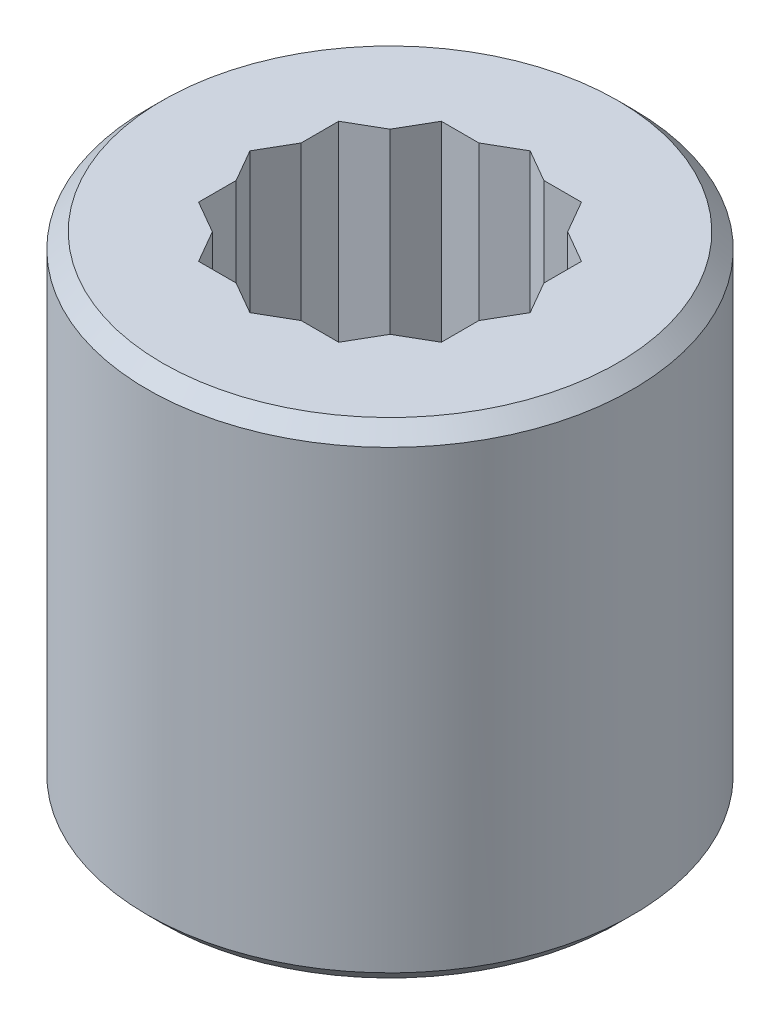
ISO-10303-21;
HEADER;
FILE_DESCRIPTION(('STEP AP214'),'2;1');
FILE_NAME('part.step','',(''),(''),'','','');
FILE_SCHEMA(('AUTOMOTIVE_DESIGN { 1 0 10303 214 1 1 1 1 }'));
ENDSEC;
DATA;
#1=APPLICATION_CONTEXT('core data for automotive mechanical design processes');
#2=APPLICATION_PROTOCOL_DEFINITION('international standard','automotive_design',2000,#1);
#3=PRODUCT_CONTEXT('',#1,'mechanical');
#4=PRODUCT('Part','Part','',(#3));
#5=PRODUCT_RELATED_PRODUCT_CATEGORY('part','',(#4));
#6=PRODUCT_DEFINITION_FORMATION('','',#4);
#7=PRODUCT_DEFINITION_CONTEXT('part definition',#1,'design');
#8=PRODUCT_DEFINITION('design','',#6,#7);
#9=PRODUCT_DEFINITION_SHAPE('','',#8);
#10=(LENGTH_UNIT() NAMED_UNIT(*) SI_UNIT(.MILLI.,.METRE.));
#11=(NAMED_UNIT(*) PLANE_ANGLE_UNIT() SI_UNIT($,.RADIAN.));
#12=(NAMED_UNIT(*) SI_UNIT($,.STERADIAN.) SOLID_ANGLE_UNIT());
#13=UNCERTAINTY_MEASURE_WITH_UNIT(LENGTH_MEASURE(1.E-05),#10,'distance_accuracy_value','');
#14=(GEOMETRIC_REPRESENTATION_CONTEXT(3) GLOBAL_UNCERTAINTY_ASSIGNED_CONTEXT((#13)) GLOBAL_UNIT_ASSIGNED_CONTEXT((#10,
#11,#12)) REPRESENTATION_CONTEXT('',''));
#15=CARTESIAN_POINT('',(0.,0.,0.));
#16=DIRECTION('',(0.,0.,1.));
#17=DIRECTION('',(1.,0.,0.));
#18=AXIS2_PLACEMENT_3D('',#15,#16,#17);
#19=CARTESIAN_POINT('',(3.66617420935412,12.7,6.35));
#20=DIRECTION('',(0.866025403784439,0.,0.5));
#21=DIRECTION('',(0.5,0.,-0.866025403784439));
#22=AXIS2_PLACEMENT_3D('',#19,#20,#21);
#23=PLANE('',#22);
#24=DIRECTION('',(0.5,0.,-0.866025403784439));
#25=VECTOR('',#24,1.);
#26=CARTESIAN_POINT('',(3.66617420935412,12.7,6.35));
#27=LINE('',#26,#25);
#28=CARTESIAN_POINT('',(6.35,12.7,1.70147737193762));
#29=VERTEX_POINT('',#28);
#30=CARTESIAN_POINT('',(7.33234841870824,12.7,0.));
#31=VERTEX_POINT('',#30);
#32=EDGE_CURVE('E361',#29,#31,#27,.T.);
#33=ORIENTED_EDGE('',*,*,#32,.F.);
#34=DIRECTION('',(0.,1.,0.));
#35=VECTOR('',#34,1.);
#36=CARTESIAN_POINT('',(6.35,12.7,1.70147737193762));
#37=LINE('',#36,#35);
#38=CARTESIAN_POINT('',(6.35,25.3999999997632,1.70147737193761));
#39=VERTEX_POINT('',#38);
#40=EDGE_CURVE('E334',#29,#39,#37,.T.);
#41=ORIENTED_EDGE('',*,*,#40,.T.);
#42=DIRECTION('',(0.5,0.,-0.866025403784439));
#43=VECTOR('',#42,1.);
#44=CARTESIAN_POINT('',(3.66617420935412,25.4,6.35));
#45=LINE('',#44,#43);
#46=CARTESIAN_POINT('',(7.33234841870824,25.4,0.));
#47=VERTEX_POINT('',#46);
#48=EDGE_CURVE('E337',#39,#47,#45,.T.);
#49=ORIENTED_EDGE('',*,*,#48,.T.);
#50=DIRECTION('',(0.,1.,0.));
#51=VECTOR('',#50,1.);
#52=CARTESIAN_POINT('',(7.33234841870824,12.7,0.));
#53=LINE('',#52,#51);
#54=EDGE_CURVE('E385',#31,#47,#53,.T.);
#55=ORIENTED_EDGE('',*,*,#54,.F.);
#56=EDGE_LOOP('',(#33,#41,#49,#55));
#57=FACE_BOUND('',#56,.T.);
#58=ADVANCED_FACE('F28',(#57),#23,.F.);
#59=CARTESIAN_POINT('',(-3.66617420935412,12.7,6.35));
#60=DIRECTION('',(0.,0.,1.));
#61=DIRECTION('',(1.,0.,0.));
#62=AXIS2_PLACEMENT_3D('',#59,#60,#61);
#63=PLANE('',#62);
#64=DIRECTION('',(1.,0.,0.));
#65=VECTOR('',#64,1.);
#66=CARTESIAN_POINT('',(-3.66617420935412,12.7,6.35));
#67=LINE('',#66,#65);
#68=CARTESIAN_POINT('',(1.70147737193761,12.7,6.35000000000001));
#69=VERTEX_POINT('',#68);
#70=CARTESIAN_POINT('',(3.66617420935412,12.7,6.35));
#71=VERTEX_POINT('',#70);
#72=EDGE_CURVE('E381',#69,#71,#67,.T.);
#73=ORIENTED_EDGE('',*,*,#72,.F.);
#74=DIRECTION('',(0.,1.,0.));
#75=VECTOR('',#74,1.);
#76=CARTESIAN_POINT('',(1.70147737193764,12.7,6.35));
#77=LINE('',#76,#75);
#78=CARTESIAN_POINT('',(1.70147737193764,25.3999999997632,6.35));
#79=VERTEX_POINT('',#78);
#80=EDGE_CURVE('E325',#69,#79,#77,.T.);
#81=ORIENTED_EDGE('',*,*,#80,.T.);
#82=DIRECTION('',(1.,0.,0.));
#83=VECTOR('',#82,1.);
#84=CARTESIAN_POINT('',(-3.66617420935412,25.4,6.35));
#85=LINE('',#84,#83);
#86=CARTESIAN_POINT('',(3.66617420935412,25.4,6.35));
#87=VERTEX_POINT('',#86);
#88=EDGE_CURVE('E357',#79,#87,#85,.T.);
#89=ORIENTED_EDGE('',*,*,#88,.T.);
#90=DIRECTION('',(0.,1.,0.));
#91=VECTOR('',#90,1.);
#92=CARTESIAN_POINT('',(3.66617420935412,12.7,6.35));
#93=LINE('',#92,#91);
#94=EDGE_CURVE('E386',#71,#87,#93,.T.);
#95=ORIENTED_EDGE('',*,*,#94,.F.);
#96=EDGE_LOOP('',(#73,#81,#89,#95));
#97=FACE_BOUND('',#96,.T.);
#98=ADVANCED_FACE('F460',(#97),#63,.F.);
#99=CARTESIAN_POINT('',(-7.33234841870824,12.7,0.));
#100=DIRECTION('',(-0.866025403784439,0.,0.5));
#101=DIRECTION('',(0.5,0.,0.866025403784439));
#102=AXIS2_PLACEMENT_3D('',#99,#100,#101);
#103=PLANE('',#102);
#104=DIRECTION('',(0.5,0.,0.866025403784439));
#105=VECTOR('',#104,1.);
#106=CARTESIAN_POINT('',(-7.33234841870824,12.7,0.));
#107=LINE('',#106,#105);
#108=CARTESIAN_POINT('',(-4.64852262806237,12.7,4.64852262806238));
#109=VERTEX_POINT('',#108);
#110=CARTESIAN_POINT('',(-3.66617420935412,12.7,6.35));
#111=VERTEX_POINT('',#110);
#112=EDGE_CURVE('E377',#109,#111,#107,.T.);
#113=ORIENTED_EDGE('',*,*,#112,.F.);
#114=DIRECTION('',(0.,1.,0.));
#115=VECTOR('',#114,1.);
#116=CARTESIAN_POINT('',(-4.64852262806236,12.7,4.64852262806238));
#117=LINE('',#116,#115);
#118=CARTESIAN_POINT('',(-4.64852262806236,25.3999999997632,4.64852262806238));
#119=VERTEX_POINT('',#118);
#120=EDGE_CURVE('E319',#109,#119,#117,.T.);
#121=ORIENTED_EDGE('',*,*,#120,.T.);
#122=DIRECTION('',(0.5,0.,0.866025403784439));
#123=VECTOR('',#122,1.);
#124=CARTESIAN_POINT('',(-7.33234841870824,25.4,0.));
#125=LINE('',#124,#123);
#126=CARTESIAN_POINT('',(-3.66617420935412,25.4,6.35));
#127=VERTEX_POINT('',#126);
#128=EDGE_CURVE('E353',#119,#127,#125,.T.);
#129=ORIENTED_EDGE('',*,*,#128,.T.);
#130=DIRECTION('',(0.,1.,0.));
#131=VECTOR('',#130,1.);
#132=CARTESIAN_POINT('',(-3.66617420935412,12.7,6.35));
#133=LINE('',#132,#131);
#134=EDGE_CURVE('E390',#111,#127,#133,.T.);
#135=ORIENTED_EDGE('',*,*,#134,.F.);
#136=EDGE_LOOP('',(#113,#121,#129,#135));
#137=FACE_BOUND('',#136,.T.);
#138=ADVANCED_FACE('F476',(#137),#103,.F.);
#139=CARTESIAN_POINT('',(-3.66617420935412,12.7,-6.35));
#140=DIRECTION('',(-0.866025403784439,0.,-0.5));
#141=DIRECTION('',(-0.5,0.,0.866025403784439));
#142=AXIS2_PLACEMENT_3D('',#139,#140,#141);
#143=PLANE('',#142);
#144=DIRECTION('',(-0.5,0.,0.866025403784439));
#145=VECTOR('',#144,1.);
#146=CARTESIAN_POINT('',(-3.66617420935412,12.7,-6.35));
#147=LINE('',#146,#145);
#148=CARTESIAN_POINT('',(-6.35,12.7,-1.70147737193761));
#149=VERTEX_POINT('',#148);
#150=CARTESIAN_POINT('',(-7.33234841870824,12.7,0.));
#151=VERTEX_POINT('',#150);
#152=EDGE_CURVE('E373',#149,#151,#147,.T.);
#153=ORIENTED_EDGE('',*,*,#152,.F.);
#154=DIRECTION('',(0.,1.,0.));
#155=VECTOR('',#154,1.);
#156=CARTESIAN_POINT('',(-6.35,12.7,-1.70147737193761));
#157=LINE('',#156,#155);
#158=CARTESIAN_POINT('',(-6.35,25.3999999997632,-1.70147737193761));
#159=VERTEX_POINT('',#158);
#160=EDGE_CURVE('E313',#149,#159,#157,.T.);
#161=ORIENTED_EDGE('',*,*,#160,.T.);
#162=DIRECTION('',(-0.5,0.,0.866025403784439));
#163=VECTOR('',#162,1.);
#164=CARTESIAN_POINT('',(-3.66617420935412,25.4,-6.35));
#165=LINE('',#164,#163);
#166=CARTESIAN_POINT('',(-7.33234841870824,25.4,0.));
#167=VERTEX_POINT('',#166);
#168=EDGE_CURVE('E349',#159,#167,#165,.T.);
#169=ORIENTED_EDGE('',*,*,#168,.T.);
#170=DIRECTION('',(0.,1.,0.));
#171=VECTOR('',#170,1.);
#172=CARTESIAN_POINT('',(-7.33234841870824,12.7,0.));
#173=LINE('',#172,#171);
#174=EDGE_CURVE('E393',#151,#167,#173,.T.);
#175=ORIENTED_EDGE('',*,*,#174,.F.);
#176=EDGE_LOOP('',(#153,#161,#169,#175));
#177=FACE_BOUND('',#176,.T.);
#178=ADVANCED_FACE('F495',(#177),#143,.F.);
#179=CARTESIAN_POINT('',(3.66617420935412,12.7,-6.35));
#180=DIRECTION('',(0.,0.,-1.));
#181=DIRECTION('',(-1.,0.,0.));
#182=AXIS2_PLACEMENT_3D('',#179,#180,#181);
#183=PLANE('',#182);
#184=DIRECTION('',(-1.,0.,0.));
#185=VECTOR('',#184,1.);
#186=CARTESIAN_POINT('',(3.66617420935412,12.7,-6.35));
#187=LINE('',#186,#185);
#188=CARTESIAN_POINT('',(-1.70147737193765,12.7,-6.35));
#189=VERTEX_POINT('',#188);
#190=CARTESIAN_POINT('',(-3.66617420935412,12.7,-6.35));
#191=VERTEX_POINT('',#190);
#192=EDGE_CURVE('E369',#189,#191,#187,.T.);
#193=ORIENTED_EDGE('',*,*,#192,.F.);
#194=DIRECTION('',(0.,1.,0.));
#195=VECTOR('',#194,1.);
#196=CARTESIAN_POINT('',(-1.70147737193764,12.7,-6.35));
#197=LINE('',#196,#195);
#198=CARTESIAN_POINT('',(-1.70147737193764,25.3999999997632,-6.35));
#199=VERTEX_POINT('',#198);
#200=EDGE_CURVE('E307',#189,#199,#197,.T.);
#201=ORIENTED_EDGE('',*,*,#200,.T.);
#202=DIRECTION('',(-1.,0.,0.));
#203=VECTOR('',#202,1.);
#204=CARTESIAN_POINT('',(3.66617420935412,25.4,-6.35));
#205=LINE('',#204,#203);
#206=CARTESIAN_POINT('',(-3.66617420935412,25.4,-6.35));
#207=VERTEX_POINT('',#206);
#208=EDGE_CURVE('E345',#199,#207,#205,.T.);
#209=ORIENTED_EDGE('',*,*,#208,.T.);
#210=DIRECTION('',(0.,1.,0.));
#211=VECTOR('',#210,1.);
#212=CARTESIAN_POINT('',(-3.66617420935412,12.7,-6.35));
#213=LINE('',#212,#211);
#214=EDGE_CURVE('E396',#191,#207,#213,.T.);
#215=ORIENTED_EDGE('',*,*,#214,.F.);
#216=EDGE_LOOP('',(#193,#201,#209,#215));
#217=FACE_BOUND('',#216,.T.);
#218=ADVANCED_FACE('F513',(#217),#183,.F.);
#219=CARTESIAN_POINT('',(7.33234841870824,12.7,0.));
#220=DIRECTION('',(0.866025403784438,0.,-0.5));
#221=DIRECTION('',(-0.5,0.,-0.866025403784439));
#222=AXIS2_PLACEMENT_3D('',#219,#220,#221);
#223=PLANE('',#222);
#224=DIRECTION('',(-0.5,0.,-0.866025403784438));
#225=VECTOR('',#224,1.);
#226=CARTESIAN_POINT('',(7.33234841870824,25.4,0.));
#227=LINE('',#226,#225);
#228=CARTESIAN_POINT('',(6.35,25.3999999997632,-1.70147737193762));
#229=VERTEX_POINT('',#228);
#230=EDGE_CURVE('E342',#47,#229,#227,.T.);
#231=ORIENTED_EDGE('',*,*,#230,.T.);
#232=DIRECTION('',(0.,-1.,0.));
#233=VECTOR('',#232,1.);
#234=CARTESIAN_POINT('',(6.35,12.7,-1.70147737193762));
#235=LINE('',#234,#233);
#236=CARTESIAN_POINT('',(6.35,12.7,-1.70147737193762));
#237=VERTEX_POINT('',#236);
#238=EDGE_CURVE('E331',#229,#237,#235,.T.);
#239=ORIENTED_EDGE('',*,*,#238,.T.);
#240=DIRECTION('',(-0.5,0.,-0.866025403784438));
#241=VECTOR('',#240,1.);
#242=CARTESIAN_POINT('',(7.33234841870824,12.7,0.));
#243=LINE('',#242,#241);
#244=EDGE_CURVE('E366',#31,#237,#243,.T.);
#245=ORIENTED_EDGE('',*,*,#244,.F.);
#246=ORIENTED_EDGE('',*,*,#54,.T.);
#247=EDGE_LOOP('',(#231,#239,#245,#246));
#248=FACE_BOUND('',#247,.T.);
#249=ADVANCED_FACE('F424',(#248),#223,.F.);
#250=CARTESIAN_POINT('',(0.,25.4,0.));
#251=DIRECTION('',(0.,-1.,0.));
#252=DIRECTION('',(0.,0.,-1.));
#253=AXIS2_PLACEMENT_3D('',#250,#251,#252);
#254=CYLINDRICAL_SURFACE('',#253,12.7);
#255=CARTESIAN_POINT('',(0.,0.793749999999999,0.));
#256=DIRECTION('',(0.,1.,0.));
#257=DIRECTION('',(0.,0.,1.));
#258=AXIS2_PLACEMENT_3D('',#255,#256,#257);
#259=CIRCLE('',#258,12.7);
#260=CARTESIAN_POINT('',(0.,0.793749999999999,12.7));
#261=VERTEX_POINT('',#260);
#262=EDGE_CURVE('E406',#261,#261,#259,.T.);
#263=ORIENTED_EDGE('',*,*,#262,.T.);
#264=EDGE_LOOP('',(#263));
#265=FACE_BOUND('',#264,.T.);
#266=CARTESIAN_POINT('',(0.,24.60625,0.));
#267=DIRECTION('',(0.,1.,0.));
#268=DIRECTION('',(0.,0.,1.));
#269=AXIS2_PLACEMENT_3D('',#266,#267,#268);
#270=CIRCLE('',#269,12.7);
#271=CARTESIAN_POINT('',(0.,24.60625,-12.7));
#272=VERTEX_POINT('',#271);
#273=EDGE_CURVE('E389',#272,#272,#270,.F.);
#274=ORIENTED_EDGE('',*,*,#273,.T.);
#275=EDGE_LOOP('',(#274));
#276=FACE_BOUND('',#275,.T.);
#277=ADVANCED_FACE('F30',(#265,#276),#254,.T.);
#278=CARTESIAN_POINT('',(0.,25.4,0.));
#279=DIRECTION('',(0.,1.,0.));
#280=DIRECTION('',(0.,0.,1.));
#281=AXIS2_PLACEMENT_3D('',#278,#279,#280);
#282=PLANE('',#281);
#283=CARTESIAN_POINT('',(0.,25.4,0.));
#284=DIRECTION('',(0.,1.,0.));
#285=DIRECTION('',(0.,0.,1.));
#286=AXIS2_PLACEMENT_3D('',#283,#284,#285);
#287=CIRCLE('',#286,11.90625);
#288=CARTESIAN_POINT('',(0.,25.4,-11.90625));
#289=VERTEX_POINT('',#288);
#290=EDGE_CURVE('E11',#289,#289,#287,.T.);
#291=ORIENTED_EDGE('',*,*,#290,.T.);
#292=EDGE_LOOP('',(#291));
#293=FACE_BOUND('',#292,.T.);
#294=DIRECTION('',(0.,0.,-1.));
#295=VECTOR('',#294,1.);
#296=CARTESIAN_POINT('',(6.35,25.3999999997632,3.66617420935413));
#297=LINE('',#296,#295);
#298=CARTESIAN_POINT('',(6.35,25.3999999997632,3.66617420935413));
#299=VERTEX_POINT('',#298);
#300=EDGE_CURVE('E264',#299,#39,#297,.T.);
#301=ORIENTED_EDGE('',*,*,#300,.F.);
#302=DIRECTION('',(0.866025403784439,0.,-0.5));
#303=VECTOR('',#302,1.);
#304=CARTESIAN_POINT('',(0.,25.3999999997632,7.33234841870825));
#305=LINE('',#304,#303);
#306=CARTESIAN_POINT('',(4.64852262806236,25.3999999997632,4.64852262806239));
#307=VERTEX_POINT('',#306);
#308=EDGE_CURVE('E278',#307,#299,#305,.T.);
#309=ORIENTED_EDGE('',*,*,#308,.F.);
#310=EDGE_CURVE('E338',#87,#307,#45,.T.);
#311=ORIENTED_EDGE('',*,*,#310,.F.);
#312=ORIENTED_EDGE('',*,*,#88,.F.);
#313=CARTESIAN_POINT('',(0.,25.3999999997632,7.33234841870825));
#314=VERTEX_POINT('',#313);
#315=EDGE_CURVE('E279',#314,#79,#305,.T.);
#316=ORIENTED_EDGE('',*,*,#315,.F.);
#317=DIRECTION('',(0.866025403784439,0.,0.5));
#318=VECTOR('',#317,1.);
#319=CARTESIAN_POINT('',(-6.35,25.3999999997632,3.66617420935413));
#320=LINE('',#319,#318);
#321=CARTESIAN_POINT('',(-1.70147737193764,25.3999999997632,6.35));
#322=VERTEX_POINT('',#321);
#323=EDGE_CURVE('E275',#322,#314,#320,.T.);
#324=ORIENTED_EDGE('',*,*,#323,.F.);
#325=EDGE_CURVE('E358',#127,#322,#85,.T.);
#326=ORIENTED_EDGE('',*,*,#325,.F.);
#327=ORIENTED_EDGE('',*,*,#128,.F.);
#328=CARTESIAN_POINT('',(-6.35,25.3999999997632,3.66617420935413));
#329=VERTEX_POINT('',#328);
#330=EDGE_CURVE('E276',#329,#119,#320,.T.);
#331=ORIENTED_EDGE('',*,*,#330,.F.);
#332=DIRECTION('',(0.,0.,1.));
#333=VECTOR('',#332,1.);
#334=CARTESIAN_POINT('',(-6.35,25.3999999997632,-3.66617420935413));
#335=LINE('',#334,#333);
#336=CARTESIAN_POINT('',(-6.35,25.3999999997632,1.70147737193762));
#337=VERTEX_POINT('',#336);
#338=EDGE_CURVE('E272',#337,#329,#335,.T.);
#339=ORIENTED_EDGE('',*,*,#338,.F.);
#340=EDGE_CURVE('E354',#167,#337,#125,.T.);
#341=ORIENTED_EDGE('',*,*,#340,.F.);
#342=ORIENTED_EDGE('',*,*,#168,.F.);
#343=CARTESIAN_POINT('',(-6.35,25.3999999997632,-3.66617420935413));
#344=VERTEX_POINT('',#343);
#345=EDGE_CURVE('E273',#344,#159,#335,.T.);
#346=ORIENTED_EDGE('',*,*,#345,.F.);
#347=DIRECTION('',(-0.866025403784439,0.,0.5));
#348=VECTOR('',#347,1.);
#349=CARTESIAN_POINT('',(0.,25.3999999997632,-7.33234841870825));
#350=LINE('',#349,#348);
#351=CARTESIAN_POINT('',(-4.64852262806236,25.3999999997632,-4.64852262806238));
#352=VERTEX_POINT('',#351);
#353=EDGE_CURVE('E269',#352,#344,#350,.T.);
#354=ORIENTED_EDGE('',*,*,#353,.F.);
#355=EDGE_CURVE('E350',#207,#352,#165,.T.);
#356=ORIENTED_EDGE('',*,*,#355,.F.);
#357=ORIENTED_EDGE('',*,*,#208,.F.);
#358=CARTESIAN_POINT('',(0.,25.3999999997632,-7.33234841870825));
#359=VERTEX_POINT('',#358);
#360=EDGE_CURVE('E270',#359,#199,#350,.T.);
#361=ORIENTED_EDGE('',*,*,#360,.F.);
#362=DIRECTION('',(-0.866025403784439,0.,-0.5));
#363=VECTOR('',#362,1.);
#364=CARTESIAN_POINT('',(6.35,25.3999999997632,-3.66617420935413));
#365=LINE('',#364,#363);
#366=CARTESIAN_POINT('',(1.70147737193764,25.3999999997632,-6.35));
#367=VERTEX_POINT('',#366);
#368=EDGE_CURVE('E266',#367,#359,#365,.T.);
#369=ORIENTED_EDGE('',*,*,#368,.F.);
#370=CARTESIAN_POINT('',(3.66617420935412,25.4,-6.35));
#371=VERTEX_POINT('',#370);
#372=EDGE_CURVE('E346',#371,#367,#205,.T.);
#373=ORIENTED_EDGE('',*,*,#372,.F.);
#374=CARTESIAN_POINT('',(4.64852262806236,25.3999999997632,-4.64852262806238));
#375=VERTEX_POINT('',#374);
#376=EDGE_CURVE('E341',#375,#371,#227,.T.);
#377=ORIENTED_EDGE('',*,*,#376,.F.);
#378=CARTESIAN_POINT('',(6.35,25.3999999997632,-3.66617420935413));
#379=VERTEX_POINT('',#378);
#380=EDGE_CURVE('E267',#379,#375,#365,.T.);
#381=ORIENTED_EDGE('',*,*,#380,.F.);
#382=EDGE_CURVE('E219',#229,#379,#297,.T.);
#383=ORIENTED_EDGE('',*,*,#382,.F.);
#384=ORIENTED_EDGE('',*,*,#230,.F.);
#385=ORIENTED_EDGE('',*,*,#48,.F.);
#386=EDGE_LOOP('',(#301,#309,#311,#312,#316,#324,#326,#327,#331,#339,#341,#342,#346,#354,#356,
#357,#361,#369,#373,#377,#381,#383,#384,#385));
#387=FACE_BOUND('',#386,.T.);
#388=ADVANCED_FACE('F423',(#293,#387),#282,.T.);
#389=CARTESIAN_POINT('',(0.,0.,0.));
#390=DIRECTION('',(0.,1.,0.));
#391=DIRECTION('',(0.,0.,1.));
#392=AXIS2_PLACEMENT_3D('',#389,#390,#391);
#393=PLANE('',#392);
#394=CARTESIAN_POINT('',(0.,0.,0.));
#395=DIRECTION('',(0.,1.,0.));
#396=DIRECTION('',(0.,0.,1.));
#397=AXIS2_PLACEMENT_3D('',#394,#395,#396);
#398=CIRCLE('',#397,11.90625);
#399=CARTESIAN_POINT('',(0.,0.,11.90625));
#400=VERTEX_POINT('',#399);
#401=EDGE_CURVE('E36',#400,#400,#398,.F.);
#402=ORIENTED_EDGE('',*,*,#401,.T.);
#403=EDGE_LOOP('',(#402));
#404=FACE_BOUND('',#403,.T.);
#405=DIRECTION('',(1.,0.,0.));
#406=VECTOR('',#405,1.);
#407=CARTESIAN_POINT('',(-3.175,0.,-3.175));
#408=LINE('',#407,#406);
#409=CARTESIAN_POINT('',(-3.175,0.,-3.175));
#410=VERTEX_POINT('',#409);
#411=CARTESIAN_POINT('',(3.175,0.,-3.175));
#412=VERTEX_POINT('',#411);
#413=EDGE_CURVE('E232',#410,#412,#408,.T.);
#414=ORIENTED_EDGE('',*,*,#413,.F.);
#415=DIRECTION('',(0.,0.,-1.));
#416=VECTOR('',#415,1.);
#417=CARTESIAN_POINT('',(-3.175,0.,3.175));
#418=LINE('',#417,#416);
#419=CARTESIAN_POINT('',(-3.175,0.,3.175));
#420=VERTEX_POINT('',#419);
#421=EDGE_CURVE('E43',#420,#410,#418,.T.);
#422=ORIENTED_EDGE('',*,*,#421,.F.);
#423=DIRECTION('',(-1.,0.,0.));
#424=VECTOR('',#423,1.);
#425=CARTESIAN_POINT('',(-3.175,0.,3.175));
#426=LINE('',#425,#424);
#427=CARTESIAN_POINT('',(3.175,0.,3.175));
#428=VERTEX_POINT('',#427);
#429=EDGE_CURVE('E225',#428,#420,#426,.T.);
#430=ORIENTED_EDGE('',*,*,#429,.F.);
#431=DIRECTION('',(0.,0.,1.));
#432=VECTOR('',#431,1.);
#433=CARTESIAN_POINT('',(3.175,0.,3.175));
#434=LINE('',#433,#432);
#435=EDGE_CURVE('E239',#412,#428,#434,.T.);
#436=ORIENTED_EDGE('',*,*,#435,.F.);
#437=EDGE_LOOP('',(#414,#422,#430,#436));
#438=FACE_BOUND('',#437,.T.);
#439=ADVANCED_FACE('F411',(#404,#438),#393,.F.);
#440=ORIENTED_EDGE('',*,*,#310,.T.);
#441=DIRECTION('',(0.,-1.,0.));
#442=VECTOR('',#441,1.);
#443=CARTESIAN_POINT('',(4.64852262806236,12.7,4.64852262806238));
#444=LINE('',#443,#442);
#445=CARTESIAN_POINT('',(4.64852262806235,12.7,4.64852262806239));
#446=VERTEX_POINT('',#445);
#447=EDGE_CURVE('E328',#307,#446,#444,.T.);
#448=ORIENTED_EDGE('',*,*,#447,.T.);
#449=EDGE_CURVE('E362',#71,#446,#27,.T.);
#450=ORIENTED_EDGE('',*,*,#449,.F.);
#451=ORIENTED_EDGE('',*,*,#94,.T.);
#452=EDGE_LOOP('',(#440,#448,#450,#451));
#453=FACE_BOUND('',#452,.T.);
#454=ADVANCED_FACE('F453',(#453),#23,.F.);
#455=ORIENTED_EDGE('',*,*,#325,.T.);
#456=DIRECTION('',(0.,-1.,0.));
#457=VECTOR('',#456,1.);
#458=CARTESIAN_POINT('',(-1.70147737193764,12.7,6.35));
#459=LINE('',#458,#457);
#460=CARTESIAN_POINT('',(-1.70147737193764,12.7,6.35));
#461=VERTEX_POINT('',#460);
#462=EDGE_CURVE('E322',#322,#461,#459,.T.);
#463=ORIENTED_EDGE('',*,*,#462,.T.);
#464=EDGE_CURVE('E382',#111,#461,#67,.T.);
#465=ORIENTED_EDGE('',*,*,#464,.F.);
#466=ORIENTED_EDGE('',*,*,#134,.T.);
#467=EDGE_LOOP('',(#455,#463,#465,#466));
#468=FACE_BOUND('',#467,.T.);
#469=ADVANCED_FACE('F471',(#468),#63,.F.);
#470=ORIENTED_EDGE('',*,*,#340,.T.);
#471=DIRECTION('',(0.,-1.,0.));
#472=VECTOR('',#471,1.);
#473=CARTESIAN_POINT('',(-6.35,12.7,1.70147737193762));
#474=LINE('',#473,#472);
#475=CARTESIAN_POINT('',(-6.35,12.7,1.70147737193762));
#476=VERTEX_POINT('',#475);
#477=EDGE_CURVE('E316',#337,#476,#474,.T.);
#478=ORIENTED_EDGE('',*,*,#477,.T.);
#479=EDGE_CURVE('E378',#151,#476,#107,.T.);
#480=ORIENTED_EDGE('',*,*,#479,.F.);
#481=ORIENTED_EDGE('',*,*,#174,.T.);
#482=EDGE_LOOP('',(#470,#478,#480,#481));
#483=FACE_BOUND('',#482,.T.);
#484=ADVANCED_FACE('F489',(#483),#103,.F.);
#485=ORIENTED_EDGE('',*,*,#355,.T.);
#486=DIRECTION('',(0.,-1.,0.));
#487=VECTOR('',#486,1.);
#488=CARTESIAN_POINT('',(-4.64852262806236,12.7,-4.64852262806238));
#489=LINE('',#488,#487);
#490=CARTESIAN_POINT('',(-4.64852262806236,12.7,-4.64852262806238));
#491=VERTEX_POINT('',#490);
#492=EDGE_CURVE('E310',#352,#491,#489,.T.);
#493=ORIENTED_EDGE('',*,*,#492,.T.);
#494=EDGE_CURVE('E374',#191,#491,#147,.T.);
#495=ORIENTED_EDGE('',*,*,#494,.F.);
#496=ORIENTED_EDGE('',*,*,#214,.T.);
#497=EDGE_LOOP('',(#485,#493,#495,#496));
#498=FACE_BOUND('',#497,.T.);
#499=ADVANCED_FACE('F507',(#498),#143,.F.);
#500=ORIENTED_EDGE('',*,*,#372,.T.);
#501=DIRECTION('',(0.,-1.,0.));
#502=VECTOR('',#501,1.);
#503=CARTESIAN_POINT('',(1.70147737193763,12.7,-6.35));
#504=LINE('',#503,#502);
#505=CARTESIAN_POINT('',(1.70147737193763,12.7,-6.35));
#506=VERTEX_POINT('',#505);
#507=EDGE_CURVE('E304',#367,#506,#504,.T.);
#508=ORIENTED_EDGE('',*,*,#507,.T.);
#509=CARTESIAN_POINT('',(3.66617420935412,12.7,-6.35));
#510=VERTEX_POINT('',#509);
#511=EDGE_CURVE('E370',#510,#506,#187,.T.);
#512=ORIENTED_EDGE('',*,*,#511,.F.);
#513=DIRECTION('',(0.,1.,0.));
#514=VECTOR('',#513,1.);
#515=CARTESIAN_POINT('',(3.66617420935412,12.7,-6.35));
#516=LINE('',#515,#514);
#517=EDGE_CURVE('E399',#510,#371,#516,.T.);
#518=ORIENTED_EDGE('',*,*,#517,.T.);
#519=EDGE_LOOP('',(#500,#508,#512,#518));
#520=FACE_BOUND('',#519,.T.);
#521=ADVANCED_FACE('F527',(#520),#183,.F.);
#522=CARTESIAN_POINT('',(4.64852262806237,12.7,-4.64852262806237));
#523=VERTEX_POINT('',#522);
#524=EDGE_CURVE('E365',#523,#510,#243,.T.);
#525=ORIENTED_EDGE('',*,*,#524,.F.);
#526=DIRECTION('',(0.,1.,0.));
#527=VECTOR('',#526,1.);
#528=CARTESIAN_POINT('',(4.64852262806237,12.7,-4.64852262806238));
#529=LINE('',#528,#527);
#530=EDGE_CURVE('E301',#523,#375,#529,.T.);
#531=ORIENTED_EDGE('',*,*,#530,.T.);
#532=ORIENTED_EDGE('',*,*,#376,.T.);
#533=ORIENTED_EDGE('',*,*,#517,.F.);
#534=EDGE_LOOP('',(#525,#531,#532,#533));
#535=FACE_BOUND('',#534,.T.);
#536=ADVANCED_FACE('F532',(#535),#223,.F.);
#537=CARTESIAN_POINT('',(10.9985226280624,12.7,-6.35));
#538=DIRECTION('',(0.,1.,0.));
#539=DIRECTION('',(0.,0.,1.));
#540=AXIS2_PLACEMENT_3D('',#537,#538,#539);
#541=PLANE('',#540);
#542=DIRECTION('',(0.,0.,-1.));
#543=VECTOR('',#542,1.);
#544=CARTESIAN_POINT('',(-3.175,12.7,3.175));
#545=LINE('',#544,#543);
#546=CARTESIAN_POINT('',(-3.175,12.7,3.175));
#547=VERTEX_POINT('',#546);
#548=CARTESIAN_POINT('',(-3.175,12.7,-3.175));
#549=VERTEX_POINT('',#548);
#550=EDGE_CURVE('E223',#547,#549,#545,.T.);
#551=ORIENTED_EDGE('',*,*,#550,.T.);
#552=DIRECTION('',(1.,0.,0.));
#553=VECTOR('',#552,1.);
#554=CARTESIAN_POINT('',(-3.175,12.7,-3.175));
#555=LINE('',#554,#553);
#556=CARTESIAN_POINT('',(3.175,12.7,-3.175));
#557=VERTEX_POINT('',#556);
#558=EDGE_CURVE('E212',#549,#557,#555,.T.);
#559=ORIENTED_EDGE('',*,*,#558,.T.);
#560=DIRECTION('',(0.,0.,1.));
#561=VECTOR('',#560,1.);
#562=CARTESIAN_POINT('',(3.175,12.7,3.175));
#563=LINE('',#562,#561);
#564=CARTESIAN_POINT('',(3.175,12.7,3.175));
#565=VERTEX_POINT('',#564);
#566=EDGE_CURVE('E234',#557,#565,#563,.T.);
#567=ORIENTED_EDGE('',*,*,#566,.T.);
#568=DIRECTION('',(-1.,0.,0.));
#569=VECTOR('',#568,1.);
#570=CARTESIAN_POINT('',(-3.175,12.7,3.175));
#571=LINE('',#570,#569);
#572=EDGE_CURVE('E230',#565,#547,#571,.T.);
#573=ORIENTED_EDGE('',*,*,#572,.T.);
#574=EDGE_LOOP('',(#551,#559,#567,#573));
#575=FACE_BOUND('',#574,.T.);
#576=ORIENTED_EDGE('',*,*,#511,.T.);
#577=DIRECTION('',(0.866025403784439,0.,0.5));
#578=VECTOR('',#577,1.);
#579=CARTESIAN_POINT('',(6.35,12.7,-3.66617420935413));
#580=LINE('',#579,#578);
#581=CARTESIAN_POINT('',(0.,12.7,-7.33234841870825));
#582=VERTEX_POINT('',#581);
#583=EDGE_CURVE('E299',#582,#506,#580,.T.);
#584=ORIENTED_EDGE('',*,*,#583,.F.);
#585=DIRECTION('',(0.866025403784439,0.,-0.5));
#586=VECTOR('',#585,1.);
#587=CARTESIAN_POINT('',(0.,12.7,-7.33234841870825));
#588=LINE('',#587,#586);
#589=EDGE_CURVE('E251',#189,#582,#588,.T.);
#590=ORIENTED_EDGE('',*,*,#589,.F.);
#591=ORIENTED_EDGE('',*,*,#192,.T.);
#592=ORIENTED_EDGE('',*,*,#494,.T.);
#593=CARTESIAN_POINT('',(-6.35,12.7,-3.66617420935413));
#594=VERTEX_POINT('',#593);
#595=EDGE_CURVE('E248',#594,#491,#588,.T.);
#596=ORIENTED_EDGE('',*,*,#595,.F.);
#597=DIRECTION('',(0.,0.,-1.));
#598=VECTOR('',#597,1.);
#599=CARTESIAN_POINT('',(-6.35,12.7,-3.66617420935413));
#600=LINE('',#599,#598);
#601=EDGE_CURVE('E250',#149,#594,#600,.T.);
#602=ORIENTED_EDGE('',*,*,#601,.F.);
#603=ORIENTED_EDGE('',*,*,#152,.T.);
#604=ORIENTED_EDGE('',*,*,#479,.T.);
#605=CARTESIAN_POINT('',(-6.35,12.7,3.66617420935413));
#606=VERTEX_POINT('',#605);
#607=EDGE_CURVE('E252',#606,#476,#600,.T.);
#608=ORIENTED_EDGE('',*,*,#607,.F.);
#609=DIRECTION('',(-0.866025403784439,0.,-0.5));
#610=VECTOR('',#609,1.);
#611=CARTESIAN_POINT('',(-6.35,12.7,3.66617420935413));
#612=LINE('',#611,#610);
#613=EDGE_CURVE('E254',#109,#606,#612,.T.);
#614=ORIENTED_EDGE('',*,*,#613,.F.);
#615=ORIENTED_EDGE('',*,*,#112,.T.);
#616=ORIENTED_EDGE('',*,*,#464,.T.);
#617=CARTESIAN_POINT('',(0.,12.7,7.33234841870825));
#618=VERTEX_POINT('',#617);
#619=EDGE_CURVE('E255',#618,#461,#612,.T.);
#620=ORIENTED_EDGE('',*,*,#619,.F.);
#621=DIRECTION('',(-0.866025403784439,0.,0.5));
#622=VECTOR('',#621,1.);
#623=CARTESIAN_POINT('',(0.,12.7,7.33234841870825));
#624=LINE('',#623,#622);
#625=EDGE_CURVE('E257',#69,#618,#624,.T.);
#626=ORIENTED_EDGE('',*,*,#625,.F.);
#627=ORIENTED_EDGE('',*,*,#72,.T.);
#628=ORIENTED_EDGE('',*,*,#449,.T.);
#629=CARTESIAN_POINT('',(6.35,12.7,3.66617420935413));
#630=VERTEX_POINT('',#629);
#631=EDGE_CURVE('E258',#630,#446,#624,.T.);
#632=ORIENTED_EDGE('',*,*,#631,.F.);
#633=DIRECTION('',(0.,0.,1.));
#634=VECTOR('',#633,1.);
#635=CARTESIAN_POINT('',(6.35,12.7,3.66617420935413));
#636=LINE('',#635,#634);
#637=EDGE_CURVE('E260',#29,#630,#636,.T.);
#638=ORIENTED_EDGE('',*,*,#637,.F.);
#639=ORIENTED_EDGE('',*,*,#32,.T.);
#640=ORIENTED_EDGE('',*,*,#244,.T.);
#641=CARTESIAN_POINT('',(6.35,12.7,-3.66617420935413));
#642=VERTEX_POINT('',#641);
#643=EDGE_CURVE('E261',#642,#237,#636,.T.);
#644=ORIENTED_EDGE('',*,*,#643,.F.);
#645=EDGE_CURVE('E263',#523,#642,#580,.T.);
#646=ORIENTED_EDGE('',*,*,#645,.F.);
#647=ORIENTED_EDGE('',*,*,#524,.T.);
#648=EDGE_LOOP('',(#576,#584,#590,#591,#592,#596,#602,#603,#604,#608,#614,#615,#616,#620,#626,
#627,#628,#632,#638,#639,#640,#644,#646,#647));
#649=FACE_BOUND('',#648,.T.);
#650=ADVANCED_FACE('F228',(#575,#649),#541,.T.);
#651=CARTESIAN_POINT('',(6.35,-6.69957044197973,-3.66617420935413));
#652=DIRECTION('',(0.5,0.,-0.866025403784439));
#653=DIRECTION('',(-0.866025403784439,0.,-0.5));
#654=AXIS2_PLACEMENT_3D('',#651,#652,#653);
#655=PLANE('',#654);
#656=ORIENTED_EDGE('',*,*,#645,.T.);
#657=DIRECTION('',(0.,1.,0.));
#658=VECTOR('',#657,1.);
#659=CARTESIAN_POINT('',(6.35,-6.69957044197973,-3.66617420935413));
#660=LINE('',#659,#658);
#661=EDGE_CURVE('E281',#642,#379,#660,.T.);
#662=ORIENTED_EDGE('',*,*,#661,.T.);
#663=ORIENTED_EDGE('',*,*,#380,.T.);
#664=ORIENTED_EDGE('',*,*,#530,.F.);
#665=EDGE_LOOP('',(#656,#662,#663,#664));
#666=FACE_BOUND('',#665,.T.);
#667=ADVANCED_FACE('F535',(#666),#655,.F.);
#668=CARTESIAN_POINT('',(6.35,-6.69957044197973,3.66617420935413));
#669=DIRECTION('',(1.,0.,0.));
#670=DIRECTION('',(0.,0.,-1.));
#671=AXIS2_PLACEMENT_3D('',#668,#669,#670);
#672=PLANE('',#671);
#673=ORIENTED_EDGE('',*,*,#382,.T.);
#674=ORIENTED_EDGE('',*,*,#661,.F.);
#675=ORIENTED_EDGE('',*,*,#643,.T.);
#676=ORIENTED_EDGE('',*,*,#238,.F.);
#677=EDGE_LOOP('',(#673,#674,#675,#676));
#678=FACE_BOUND('',#677,.T.);
#679=ADVANCED_FACE('F538',(#678),#672,.F.);
#680=ORIENTED_EDGE('',*,*,#368,.T.);
#681=DIRECTION('',(0.,1.,0.));
#682=VECTOR('',#681,1.);
#683=CARTESIAN_POINT('',(0.,-6.69957044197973,-7.33234841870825));
#684=LINE('',#683,#682);
#685=EDGE_CURVE('E294',#582,#359,#684,.T.);
#686=ORIENTED_EDGE('',*,*,#685,.F.);
#687=ORIENTED_EDGE('',*,*,#583,.T.);
#688=ORIENTED_EDGE('',*,*,#507,.F.);
#689=EDGE_LOOP('',(#680,#686,#687,#688));
#690=FACE_BOUND('',#689,.T.);
#691=ADVANCED_FACE('F522',(#690),#655,.F.);
#692=CARTESIAN_POINT('',(0.,-6.69957044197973,-7.33234841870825));
#693=DIRECTION('',(-0.5,0.,-0.866025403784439));
#694=DIRECTION('',(-0.866025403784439,0.,0.5));
#695=AXIS2_PLACEMENT_3D('',#692,#693,#694);
#696=PLANE('',#695);
#697=ORIENTED_EDGE('',*,*,#589,.T.);
#698=ORIENTED_EDGE('',*,*,#685,.T.);
#699=ORIENTED_EDGE('',*,*,#360,.T.);
#700=ORIENTED_EDGE('',*,*,#200,.F.);
#701=EDGE_LOOP('',(#697,#698,#699,#700));
#702=FACE_BOUND('',#701,.T.);
#703=ADVANCED_FACE('F519',(#702),#696,.F.);
#704=ORIENTED_EDGE('',*,*,#353,.T.);
#705=DIRECTION('',(0.,1.,0.));
#706=VECTOR('',#705,1.);
#707=CARTESIAN_POINT('',(-6.35,-6.69957044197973,-3.66617420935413));
#708=LINE('',#707,#706);
#709=EDGE_CURVE('E291',#594,#344,#708,.T.);
#710=ORIENTED_EDGE('',*,*,#709,.F.);
#711=ORIENTED_EDGE('',*,*,#595,.T.);
#712=ORIENTED_EDGE('',*,*,#492,.F.);
#713=EDGE_LOOP('',(#704,#710,#711,#712));
#714=FACE_BOUND('',#713,.T.);
#715=ADVANCED_FACE('F504',(#714),#696,.F.);
#716=CARTESIAN_POINT('',(-6.35,-6.69957044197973,-3.66617420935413));
#717=DIRECTION('',(-1.,0.,0.));
#718=DIRECTION('',(0.,0.,1.));
#719=AXIS2_PLACEMENT_3D('',#716,#717,#718);
#720=PLANE('',#719);
#721=ORIENTED_EDGE('',*,*,#601,.T.);
#722=ORIENTED_EDGE('',*,*,#709,.T.);
#723=ORIENTED_EDGE('',*,*,#345,.T.);
#724=ORIENTED_EDGE('',*,*,#160,.F.);
#725=EDGE_LOOP('',(#721,#722,#723,#724));
#726=FACE_BOUND('',#725,.T.);
#727=ADVANCED_FACE('F501',(#726),#720,.F.);
#728=ORIENTED_EDGE('',*,*,#338,.T.);
#729=DIRECTION('',(0.,1.,0.));
#730=VECTOR('',#729,1.);
#731=CARTESIAN_POINT('',(-6.35,-6.69957044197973,3.66617420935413));
#732=LINE('',#731,#730);
#733=EDGE_CURVE('E288',#606,#329,#732,.T.);
#734=ORIENTED_EDGE('',*,*,#733,.F.);
#735=ORIENTED_EDGE('',*,*,#607,.T.);
#736=ORIENTED_EDGE('',*,*,#477,.F.);
#737=EDGE_LOOP('',(#728,#734,#735,#736));
#738=FACE_BOUND('',#737,.T.);
#739=ADVANCED_FACE('F486',(#738),#720,.F.);
#740=CARTESIAN_POINT('',(-6.35,-6.69957044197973,3.66617420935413));
#741=DIRECTION('',(-0.5,0.,0.866025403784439));
#742=DIRECTION('',(0.866025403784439,0.,0.5));
#743=AXIS2_PLACEMENT_3D('',#740,#741,#742);
#744=PLANE('',#743);
#745=ORIENTED_EDGE('',*,*,#613,.T.);
#746=ORIENTED_EDGE('',*,*,#733,.T.);
#747=ORIENTED_EDGE('',*,*,#330,.T.);
#748=ORIENTED_EDGE('',*,*,#120,.F.);
#749=EDGE_LOOP('',(#745,#746,#747,#748));
#750=FACE_BOUND('',#749,.T.);
#751=ADVANCED_FACE('F482',(#750),#744,.F.);
#752=ORIENTED_EDGE('',*,*,#323,.T.);
#753=DIRECTION('',(0.,1.,0.));
#754=VECTOR('',#753,1.);
#755=CARTESIAN_POINT('',(0.,-6.69957044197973,7.33234841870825));
#756=LINE('',#755,#754);
#757=EDGE_CURVE('E285',#618,#314,#756,.T.);
#758=ORIENTED_EDGE('',*,*,#757,.F.);
#759=ORIENTED_EDGE('',*,*,#619,.T.);
#760=ORIENTED_EDGE('',*,*,#462,.F.);
#761=EDGE_LOOP('',(#752,#758,#759,#760));
#762=FACE_BOUND('',#761,.T.);
#763=ADVANCED_FACE('F467',(#762),#744,.F.);
#764=CARTESIAN_POINT('',(0.,-6.69957044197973,7.33234841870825));
#765=DIRECTION('',(0.5,0.,0.866025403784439));
#766=DIRECTION('',(0.866025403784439,0.,-0.5));
#767=AXIS2_PLACEMENT_3D('',#764,#765,#766);
#768=PLANE('',#767);
#769=ORIENTED_EDGE('',*,*,#625,.T.);
#770=ORIENTED_EDGE('',*,*,#757,.T.);
#771=ORIENTED_EDGE('',*,*,#315,.T.);
#772=ORIENTED_EDGE('',*,*,#80,.F.);
#773=EDGE_LOOP('',(#769,#770,#771,#772));
#774=FACE_BOUND('',#773,.T.);
#775=ADVANCED_FACE('F463',(#774),#768,.F.);
#776=ORIENTED_EDGE('',*,*,#637,.T.);
#777=DIRECTION('',(0.,1.,0.));
#778=VECTOR('',#777,1.);
#779=CARTESIAN_POINT('',(6.35,-6.69957044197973,3.66617420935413));
#780=LINE('',#779,#778);
#781=EDGE_CURVE('E282',#630,#299,#780,.T.);
#782=ORIENTED_EDGE('',*,*,#781,.T.);
#783=ORIENTED_EDGE('',*,*,#300,.T.);
#784=ORIENTED_EDGE('',*,*,#40,.F.);
#785=EDGE_LOOP('',(#776,#782,#783,#784));
#786=FACE_BOUND('',#785,.T.);
#787=ADVANCED_FACE('F441',(#786),#672,.F.);
#788=ORIENTED_EDGE('',*,*,#308,.T.);
#789=ORIENTED_EDGE('',*,*,#781,.F.);
#790=ORIENTED_EDGE('',*,*,#631,.T.);
#791=ORIENTED_EDGE('',*,*,#447,.F.);
#792=EDGE_LOOP('',(#788,#789,#790,#791));
#793=FACE_BOUND('',#792,.T.);
#794=ADVANCED_FACE('F451',(#793),#768,.F.);
#795=CARTESIAN_POINT('',(-3.175,25.401,3.175));
#796=DIRECTION('',(-1.,0.,0.));
#797=DIRECTION('',(0.,0.,1.));
#798=AXIS2_PLACEMENT_3D('',#795,#796,#797);
#799=PLANE('',#798);
#800=DIRECTION('',(0.,-1.,0.));
#801=VECTOR('',#800,1.);
#802=CARTESIAN_POINT('',(-3.175,25.401,3.175));
#803=LINE('',#802,#801);
#804=EDGE_CURVE('E220',#547,#420,#803,.T.);
#805=ORIENTED_EDGE('',*,*,#804,.T.);
#806=ORIENTED_EDGE('',*,*,#421,.T.);
#807=DIRECTION('',(0.,-1.,0.));
#808=VECTOR('',#807,1.);
#809=CARTESIAN_POINT('',(-3.175,25.401,-3.175));
#810=LINE('',#809,#808);
#811=EDGE_CURVE('E214',#549,#410,#810,.T.);
#812=ORIENTED_EDGE('',*,*,#811,.F.);
#813=ORIENTED_EDGE('',*,*,#550,.F.);
#814=EDGE_LOOP('',(#805,#806,#812,#813));
#815=FACE_BOUND('',#814,.T.);
#816=ADVANCED_FACE('F222',(#815),#799,.F.);
#817=CARTESIAN_POINT('',(-3.175,25.401,3.175));
#818=DIRECTION('',(0.,0.,1.));
#819=DIRECTION('',(1.,0.,0.));
#820=AXIS2_PLACEMENT_3D('',#817,#818,#819);
#821=PLANE('',#820);
#822=DIRECTION('',(0.,-1.,0.));
#823=VECTOR('',#822,1.);
#824=CARTESIAN_POINT('',(3.175,25.401,3.175));
#825=LINE('',#824,#823);
#826=EDGE_CURVE('E245',#565,#428,#825,.T.);
#827=ORIENTED_EDGE('',*,*,#826,.T.);
#828=ORIENTED_EDGE('',*,*,#429,.T.);
#829=ORIENTED_EDGE('',*,*,#804,.F.);
#830=ORIENTED_EDGE('',*,*,#572,.F.);
#831=EDGE_LOOP('',(#827,#828,#829,#830));
#832=FACE_BOUND('',#831,.T.);
#833=ADVANCED_FACE('F585',(#832),#821,.F.);
#834=CARTESIAN_POINT('',(3.175,25.401,3.175));
#835=DIRECTION('',(1.,0.,0.));
#836=DIRECTION('',(0.,0.,-1.));
#837=AXIS2_PLACEMENT_3D('',#834,#835,#836);
#838=PLANE('',#837);
#839=DIRECTION('',(0.,-1.,0.));
#840=VECTOR('',#839,1.);
#841=CARTESIAN_POINT('',(3.175,25.401,-3.175));
#842=LINE('',#841,#840);
#843=EDGE_CURVE('E51',#557,#412,#842,.T.);
#844=ORIENTED_EDGE('',*,*,#843,.T.);
#845=ORIENTED_EDGE('',*,*,#435,.T.);
#846=ORIENTED_EDGE('',*,*,#826,.F.);
#847=ORIENTED_EDGE('',*,*,#566,.F.);
#848=EDGE_LOOP('',(#844,#845,#846,#847));
#849=FACE_BOUND('',#848,.T.);
#850=ADVANCED_FACE('F578',(#849),#838,.F.);
#851=CARTESIAN_POINT('',(-3.175,25.401,-3.175));
#852=DIRECTION('',(0.,0.,-1.));
#853=DIRECTION('',(-1.,0.,0.));
#854=AXIS2_PLACEMENT_3D('',#851,#852,#853);
#855=PLANE('',#854);
#856=ORIENTED_EDGE('',*,*,#811,.T.);
#857=ORIENTED_EDGE('',*,*,#413,.T.);
#858=ORIENTED_EDGE('',*,*,#843,.F.);
#859=ORIENTED_EDGE('',*,*,#558,.F.);
#860=EDGE_LOOP('',(#856,#857,#858,#859));
#861=FACE_BOUND('',#860,.T.);
#862=ADVANCED_FACE('F213',(#861),#855,.F.);
#863=CARTESIAN_POINT('',(0.,0.793749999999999,0.));
#864=DIRECTION('',(0.,1.,0.));
#865=DIRECTION('',(0.,0.,1.));
#866=AXIS2_PLACEMENT_3D('',#863,#864,#865);
#867=CONICAL_SURFACE('',#866,12.7,0.785398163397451);
#868=ORIENTED_EDGE('',*,*,#401,.F.);
#869=EDGE_LOOP('',(#868));
#870=FACE_BOUND('',#869,.T.);
#871=ORIENTED_EDGE('',*,*,#262,.F.);
#872=EDGE_LOOP('',(#871));
#873=FACE_BOUND('',#872,.T.);
#874=ADVANCED_FACE('F414',(#870,#873),#867,.T.);
#875=CARTESIAN_POINT('',(0.,25.4,0.));
#876=DIRECTION('',(0.,-1.,0.));
#877=DIRECTION('',(0.,0.,-1.));
#878=AXIS2_PLACEMENT_3D('',#875,#876,#877);
#879=CONICAL_SURFACE('',#878,11.90625,0.785398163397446);
#880=CARTESIAN_POINT('',(0.,24.60625,-12.7));
#881=CARTESIAN_POINT('',(0.,24.6145182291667,-12.6917317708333));
#882=CARTESIAN_POINT('',(0.,24.6227864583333,-12.6834635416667));
#883=CARTESIAN_POINT('',(0.,24.6393229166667,-12.6669270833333));
#884=CARTESIAN_POINT('',(0.,24.6475911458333,-12.6586588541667));
#885=CARTESIAN_POINT('',(0.,24.6641276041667,-12.6421223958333));
#886=CARTESIAN_POINT('',(0.,24.6723958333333,-12.6338541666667));
#887=CARTESIAN_POINT('',(0.,24.6889322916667,-12.6173177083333));
#888=CARTESIAN_POINT('',(0.,24.6972005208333,-12.6090494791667));
#889=CARTESIAN_POINT('',(0.,24.7137369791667,-12.5925130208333));
#890=CARTESIAN_POINT('',(0.,24.7220052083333,-12.5842447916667));
#891=CARTESIAN_POINT('',(0.,24.7385416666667,-12.5677083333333));
#892=CARTESIAN_POINT('',(0.,24.7468098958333,-12.5594401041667));
#893=CARTESIAN_POINT('',(0.,24.7633463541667,-12.5429036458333));
#894=CARTESIAN_POINT('',(0.,24.7716145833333,-12.5346354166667));
#895=CARTESIAN_POINT('',(0.,24.7881510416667,-12.5180989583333));
#896=CARTESIAN_POINT('',(0.,24.7964192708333,-12.5098307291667));
#897=CARTESIAN_POINT('',(0.,24.8129557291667,-12.4932942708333));
#898=CARTESIAN_POINT('',(0.,24.8212239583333,-12.4850260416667));
#899=CARTESIAN_POINT('',(0.,24.8377604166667,-12.4684895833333));
#900=CARTESIAN_POINT('',(0.,24.8460286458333,-12.4602213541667));
#901=CARTESIAN_POINT('',(0.,24.8625651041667,-12.4436848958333));
#902=CARTESIAN_POINT('',(0.,24.8708333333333,-12.4354166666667));
#903=CARTESIAN_POINT('',(0.,24.8873697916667,-12.4188802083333));
#904=CARTESIAN_POINT('',(0.,24.8956380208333,-12.4106119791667));
#905=CARTESIAN_POINT('',(0.,24.9121744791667,-12.3940755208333));
#906=CARTESIAN_POINT('',(0.,24.9204427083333,-12.3858072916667));
#907=CARTESIAN_POINT('',(0.,24.9369791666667,-12.3692708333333));
#908=CARTESIAN_POINT('',(0.,24.9452473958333,-12.3610026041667));
#909=CARTESIAN_POINT('',(0.,24.9617838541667,-12.3444661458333));
#910=CARTESIAN_POINT('',(0.,24.9700520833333,-12.3361979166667));
#911=CARTESIAN_POINT('',(0.,24.9865885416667,-12.3196614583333));
#912=CARTESIAN_POINT('',(0.,24.9948567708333,-12.3113932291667));
#913=CARTESIAN_POINT('',(0.,25.0113932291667,-12.2948567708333));
#914=CARTESIAN_POINT('',(0.,25.0196614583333,-12.2865885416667));
#915=CARTESIAN_POINT('',(0.,25.0361979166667,-12.2700520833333));
#916=CARTESIAN_POINT('',(0.,25.0444661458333,-12.2617838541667));
#917=CARTESIAN_POINT('',(0.,25.0610026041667,-12.2452473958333));
#918=CARTESIAN_POINT('',(0.,25.0692708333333,-12.2369791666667));
#919=CARTESIAN_POINT('',(0.,25.0858072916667,-12.2204427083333));
#920=CARTESIAN_POINT('',(0.,25.0940755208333,-12.2121744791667));
#921=CARTESIAN_POINT('',(0.,25.1106119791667,-12.1956380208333));
#922=CARTESIAN_POINT('',(0.,25.1188802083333,-12.1873697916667));
#923=CARTESIAN_POINT('',(0.,25.1354166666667,-12.1708333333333));
#924=CARTESIAN_POINT('',(0.,25.1436848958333,-12.1625651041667));
#925=CARTESIAN_POINT('',(0.,25.1602213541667,-12.1460286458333));
#926=CARTESIAN_POINT('',(0.,25.1684895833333,-12.1377604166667));
#927=CARTESIAN_POINT('',(0.,25.1850260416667,-12.1212239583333));
#928=CARTESIAN_POINT('',(0.,25.1932942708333,-12.1129557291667));
#929=CARTESIAN_POINT('',(0.,25.2098307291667,-12.0964192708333));
#930=CARTESIAN_POINT('',(0.,25.2180989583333,-12.0881510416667));
#931=CARTESIAN_POINT('',(0.,25.2346354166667,-12.0716145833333));
#932=CARTESIAN_POINT('',(0.,25.2429036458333,-12.0633463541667));
#933=CARTESIAN_POINT('',(0.,25.2594401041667,-12.0468098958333));
#934=CARTESIAN_POINT('',(0.,25.2677083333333,-12.0385416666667));
#935=CARTESIAN_POINT('',(0.,25.2842447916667,-12.0220052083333));
#936=CARTESIAN_POINT('',(0.,25.2925130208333,-12.0137369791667));
#937=CARTESIAN_POINT('',(0.,25.3090494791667,-11.9972005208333));
#938=CARTESIAN_POINT('',(0.,25.3173177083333,-11.9889322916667));
#939=CARTESIAN_POINT('',(0.,25.3338541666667,-11.9723958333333));
#940=CARTESIAN_POINT('',(0.,25.3421223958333,-11.9641276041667));
#941=CARTESIAN_POINT('',(0.,25.3586588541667,-11.9475911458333));
#942=CARTESIAN_POINT('',(0.,25.3669270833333,-11.9393229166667));
#943=CARTESIAN_POINT('',(0.,25.3834635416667,-11.9227864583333));
#944=CARTESIAN_POINT('',(0.,25.3917317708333,-11.9145182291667));
#945=CARTESIAN_POINT('',(0.,25.4,-11.90625));
#946=B_SPLINE_CURVE_WITH_KNOTS('',3,(#880,#881,#882,#883,#884,#885,#886,#887,#888,#889,#890,
#891,#892,#893,#894,#895,#896,#897,#898,#899,#900,#901,#902,#903,#904,#905,#906,#907,#908,#909,
#910,#911,#912,#913,#914,#915,#916,#917,#918,#919,#920,#921,#922,#923,#924,#925,#926,#927,#928,
#929,#930,#931,#932,#933,#934,#935,#936,#937,#938,#939,#940,#941,#942,#943,#944,#945),
.UNSPECIFIED.,.F.,.F.,(4,2,2,2,2,2,2,2,2,2,2,2,2,2,2,2,2,2,2,2,2,2,2,2,2,2,2,2,2,2,2,2,4),(0.,
0.0350791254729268,0.0701582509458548,0.105237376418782,0.140316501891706,0.175395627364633,
0.210474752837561,0.245553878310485,0.280633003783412,0.31571212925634,0.350791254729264,
0.385870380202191,0.420949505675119,0.456028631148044,0.49110775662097,0.526186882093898,
0.561266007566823,0.59634513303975,0.631424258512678,0.666503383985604,0.701582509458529,
0.736661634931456,0.771740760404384,0.806819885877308,0.841899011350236,0.876978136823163,
0.912057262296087,0.947136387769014,0.982215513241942,1.01729463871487,1.05237376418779,
1.08745288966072,1.12253201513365),.UNSPECIFIED.);
#947=EDGE_CURVE('BSEAM417',#272,#289,#946,.T.);
#948=ORIENTED_EDGE('',*,*,#273,.F.);
#949=ORIENTED_EDGE('',*,*,#290,.F.);
#950=ORIENTED_EDGE('',*,*,#947,.T.);
#951=ORIENTED_EDGE('',*,*,#947,.F.);
#952=EDGE_LOOP('',(#948,#950,#949,#951));
#953=FACE_BOUND('',#952,.T.);
#954=ADVANCED_FACE('F417',(#953),#879,.T.);
#955=CLOSED_SHELL('',(#58,#98,#138,#178,#218,#249,#277,#388,#439,#454,#469,#484,#499,#521,#536,
#650,#667,#679,#691,#703,#715,#727,#739,#751,#763,#775,#787,#794,#816,#833,#850,#862,#874,#954));
#956=MANIFOLD_SOLID_BREP('B2',#955);
#957=ADVANCED_BREP_SHAPE_REPRESENTATION('',(#18,#956),#14);
#958=SHAPE_DEFINITION_REPRESENTATION(#9,#957);
ENDSEC;
END-ISO-10303-21;
